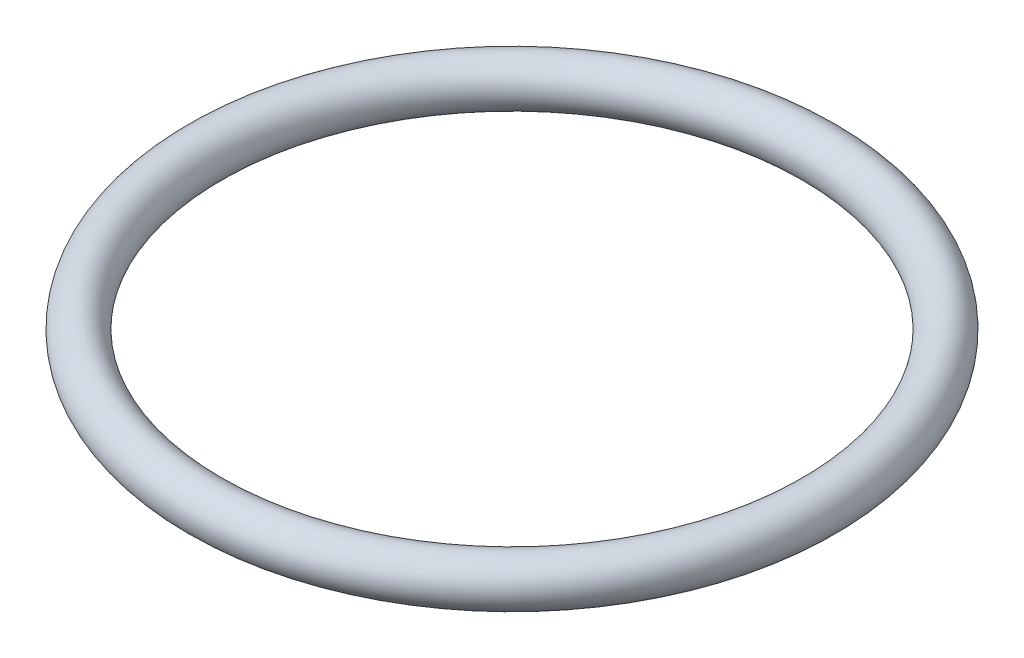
from build123d import *

# Parameters (mm, degrees)
SKETCH1_R = 0.889


with BuildPart() as part:
    # Sketch1 → Revolve1 (revolve)
    with BuildSketch(Plane.XY, mode=Mode.PRIVATE) as revolve1_sk:
        with Locations((11.8618, 0)):
            Circle(SKETCH1_R)
    revolve(revolve1_sk.sketch.rotate(Axis((0, -984.687225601, 0), (0, 1, 0)), 90), axis=Axis((0, -984.687225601, 0), (0, 1, 0)))


solid = part.part
